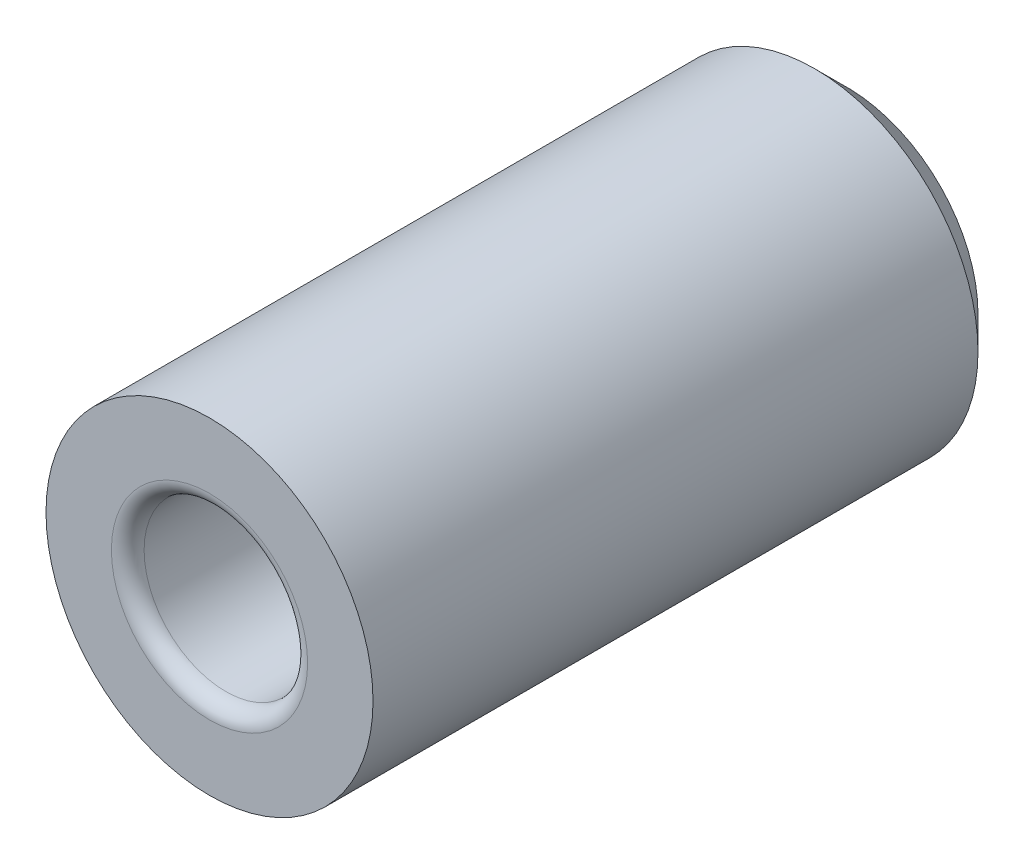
ISO-10303-21;
HEADER;
FILE_DESCRIPTION(('STEP AP214'),'2;1');
FILE_NAME('part.step','',(''),(''),'','','');
FILE_SCHEMA(('AUTOMOTIVE_DESIGN { 1 0 10303 214 1 1 1 1 }'));
ENDSEC;
DATA;
#1=APPLICATION_CONTEXT('core data for automotive mechanical design processes');
#2=APPLICATION_PROTOCOL_DEFINITION('international standard','automotive_design',2000,#1);
#3=PRODUCT_CONTEXT('',#1,'mechanical');
#4=PRODUCT('Part','Part','',(#3));
#5=PRODUCT_RELATED_PRODUCT_CATEGORY('part','',(#4));
#6=PRODUCT_DEFINITION_FORMATION('','',#4);
#7=PRODUCT_DEFINITION_CONTEXT('part definition',#1,'design');
#8=PRODUCT_DEFINITION('design','',#6,#7);
#9=PRODUCT_DEFINITION_SHAPE('','',#8);
#10=(LENGTH_UNIT() NAMED_UNIT(*) SI_UNIT(.MILLI.,.METRE.));
#11=(NAMED_UNIT(*) PLANE_ANGLE_UNIT() SI_UNIT($,.RADIAN.));
#12=(NAMED_UNIT(*) SI_UNIT($,.STERADIAN.) SOLID_ANGLE_UNIT());
#13=UNCERTAINTY_MEASURE_WITH_UNIT(LENGTH_MEASURE(1.E-05),#10,'distance_accuracy_value','');
#14=(GEOMETRIC_REPRESENTATION_CONTEXT(3) GLOBAL_UNCERTAINTY_ASSIGNED_CONTEXT((#13)) GLOBAL_UNIT_ASSIGNED_CONTEXT((#10,
#11,#12)) REPRESENTATION_CONTEXT('',''));
#15=CARTESIAN_POINT('',(0.,0.,0.));
#16=DIRECTION('',(0.,0.,1.));
#17=DIRECTION('',(1.,0.,0.));
#18=AXIS2_PLACEMENT_3D('',#15,#16,#17);
#19=CARTESIAN_POINT('',(0.,0.,-0.5));
#20=DIRECTION('',(0.,0.,-1.));
#21=DIRECTION('',(-1.,0.,0.));
#22=AXIS2_PLACEMENT_3D('',#19,#20,#21);
#23=PLANE('',#22);
#24=CARTESIAN_POINT('',(0.,0.,-0.5));
#25=DIRECTION('',(0.,0.,-1.));
#26=DIRECTION('',(-1.,0.,0.));
#27=AXIS2_PLACEMENT_3D('',#24,#25,#26);
#28=CIRCLE('',#27,3.);
#29=CARTESIAN_POINT('',(-3.,0.,-0.499999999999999));
#30=VERTEX_POINT('',#29);
#31=EDGE_CURVE('E50',#30,#30,#28,.T.);
#32=ORIENTED_EDGE('',*,*,#31,.T.);
#33=EDGE_LOOP('',(#32));
#34=FACE_BOUND('',#33,.T.);
#35=CARTESIAN_POINT('',(0.,0.,-0.5));
#36=DIRECTION('',(0.,0.,-1.));
#37=DIRECTION('',(-1.,0.,0.));
#38=AXIS2_PLACEMENT_3D('',#35,#36,#37);
#39=CIRCLE('',#38,5.);
#40=CARTESIAN_POINT('',(-5.,0.,-0.499999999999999));
#41=VERTEX_POINT('',#40);
#42=EDGE_CURVE('E64',#41,#41,#39,.T.);
#43=ORIENTED_EDGE('',*,*,#42,.F.);
#44=EDGE_LOOP('',(#43));
#45=FACE_BOUND('',#44,.T.);
#46=ADVANCED_FACE('F35',(#34,#45),#23,.F.);
#47=CARTESIAN_POINT('',(0.,0.,-0.5));
#48=DIRECTION('',(0.,0.,-1.));
#49=DIRECTION('',(-1.,0.,0.));
#50=AXIS2_PLACEMENT_3D('',#47,#48,#49);
#51=CYLINDRICAL_SURFACE('',#50,5.);
#52=CARTESIAN_POINT('',(0.,0.,-19.));
#53=DIRECTION('',(0.,0.,1.));
#54=DIRECTION('',(1.,0.,0.));
#55=AXIS2_PLACEMENT_3D('',#52,#53,#54);
#56=CIRCLE('',#55,5.);
#57=CARTESIAN_POINT('',(4.99999999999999,0.,-19.));
#58=VERTEX_POINT('',#57);
#59=EDGE_CURVE('E10',#58,#58,#56,.T.);
#60=ORIENTED_EDGE('',*,*,#59,.T.);
#61=EDGE_LOOP('',(#60));
#62=FACE_BOUND('',#61,.T.);
#63=ORIENTED_EDGE('',*,*,#42,.T.);
#64=EDGE_LOOP('',(#63));
#65=FACE_BOUND('',#64,.T.);
#66=ADVANCED_FACE('F82',(#62,#65),#51,.T.);
#67=CARTESIAN_POINT('',(0.,0.,-20.));
#68=DIRECTION('',(0.,0.,1.));
#69=DIRECTION('',(1.,0.,0.));
#70=AXIS2_PLACEMENT_3D('',#67,#68,#69);
#71=PLANE('',#70);
#72=CARTESIAN_POINT('',(0.,0.,-20.));
#73=DIRECTION('',(0.,0.,1.));
#74=DIRECTION('',(1.,0.,0.));
#75=AXIS2_PLACEMENT_3D('',#72,#73,#74);
#76=CIRCLE('',#75,4.);
#77=CARTESIAN_POINT('',(4.,0.,-20.));
#78=VERTEX_POINT('',#77);
#79=EDGE_CURVE('E42',#78,#78,#76,.F.);
#80=ORIENTED_EDGE('',*,*,#79,.T.);
#81=EDGE_LOOP('',(#80));
#82=FACE_BOUND('',#81,.T.);
#83=CARTESIAN_POINT('',(0.,0.,-20.));
#84=DIRECTION('',(0.,0.,-1.));
#85=DIRECTION('',(-1.,0.,0.));
#86=AXIS2_PLACEMENT_3D('',#83,#84,#85);
#87=CIRCLE('',#86,1.64999999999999);
#88=CARTESIAN_POINT('',(-1.64999999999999,0.,-20.));
#89=VERTEX_POINT('',#88);
#90=EDGE_CURVE('E73',#89,#89,#87,.T.);
#91=ORIENTED_EDGE('',*,*,#90,.F.);
#92=EDGE_LOOP('',(#91));
#93=FACE_BOUND('',#92,.T.);
#94=ADVANCED_FACE('F79',(#82,#93),#71,.F.);
#95=CARTESIAN_POINT('',(0.,0.,-0.5));
#96=DIRECTION('',(0.,0.,-1.));
#97=DIRECTION('',(-1.,0.,0.));
#98=AXIS2_PLACEMENT_3D('',#95,#96,#97);
#99=CYLINDRICAL_SURFACE('',#98,3.75);
#100=CARTESIAN_POINT('',(0.,0.,-6.75));
#101=DIRECTION('',(0.,0.,-1.));
#102=DIRECTION('',(-1.,0.,0.));
#103=AXIS2_PLACEMENT_3D('',#100,#101,#102);
#104=CIRCLE('',#103,3.75);
#105=CARTESIAN_POINT('',(-3.75,0.,-6.75));
#106=VERTEX_POINT('',#105);
#107=EDGE_CURVE('E58',#106,#106,#104,.F.);
#108=ORIENTED_EDGE('',*,*,#107,.T.);
#109=EDGE_LOOP('',(#108));
#110=FACE_BOUND('',#109,.T.);
#111=CARTESIAN_POINT('',(0.,0.,-12.75));
#112=DIRECTION('',(0.,0.,1.));
#113=DIRECTION('',(1.,0.,0.));
#114=AXIS2_PLACEMENT_3D('',#111,#112,#113);
#115=CIRCLE('',#114,3.75);
#116=CARTESIAN_POINT('',(3.75,0.,-12.75));
#117=VERTEX_POINT('',#116);
#118=EDGE_CURVE('E61',#117,#117,#115,.F.);
#119=ORIENTED_EDGE('',*,*,#118,.T.);
#120=EDGE_LOOP('',(#119));
#121=FACE_BOUND('',#120,.T.);
#122=ADVANCED_FACE('F81',(#110,#121),#99,.F.);
#123=CARTESIAN_POINT('',(0.,0.,-14.));
#124=DIRECTION('',(0.,0.,1.));
#125=DIRECTION('',(1.,0.,0.));
#126=AXIS2_PLACEMENT_3D('',#123,#124,#125);
#127=PLANE('',#126);
#128=CARTESIAN_POINT('',(0.,0.,-14.));
#129=DIRECTION('',(0.,0.,1.));
#130=DIRECTION('',(1.,0.,0.));
#131=AXIS2_PLACEMENT_3D('',#128,#129,#130);
#132=CIRCLE('',#131,1.64999999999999);
#133=CARTESIAN_POINT('',(1.64999999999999,0.,-14.));
#134=VERTEX_POINT('',#133);
#135=EDGE_CURVE('E70',#134,#134,#132,.T.);
#136=ORIENTED_EDGE('',*,*,#135,.F.);
#137=EDGE_LOOP('',(#136));
#138=FACE_BOUND('',#137,.T.);
#139=CARTESIAN_POINT('',(0.,0.,-14.));
#140=DIRECTION('',(0.,0.,1.));
#141=DIRECTION('',(1.,0.,0.));
#142=AXIS2_PLACEMENT_3D('',#139,#140,#141);
#143=CIRCLE('',#142,2.5);
#144=CARTESIAN_POINT('',(2.5,0.,-14.));
#145=VERTEX_POINT('',#144);
#146=EDGE_CURVE('E55',#145,#145,#143,.T.);
#147=ORIENTED_EDGE('',*,*,#146,.T.);
#148=EDGE_LOOP('',(#147));
#149=FACE_BOUND('',#148,.T.);
#150=ADVANCED_FACE('F88',(#138,#149),#127,.T.);
#151=CARTESIAN_POINT('',(0.,0.,-0.5));
#152=DIRECTION('',(0.,0.,-1.));
#153=DIRECTION('',(-1.,0.,0.));
#154=AXIS2_PLACEMENT_3D('',#151,#152,#153);
#155=CYLINDRICAL_SURFACE('',#154,2.5);
#156=CARTESIAN_POINT('',(0.,0.,-1.));
#157=DIRECTION('',(0.,0.,-1.));
#158=DIRECTION('',(-1.,0.,0.));
#159=AXIS2_PLACEMENT_3D('',#156,#157,#158);
#160=CIRCLE('',#159,2.5);
#161=CARTESIAN_POINT('',(-2.5,0.,-1.));
#162=VERTEX_POINT('',#161);
#163=EDGE_CURVE('E46',#162,#162,#160,.F.);
#164=ORIENTED_EDGE('',*,*,#163,.T.);
#165=EDGE_LOOP('',(#164));
#166=FACE_BOUND('',#165,.T.);
#167=CARTESIAN_POINT('',(0.,0.,-5.5));
#168=DIRECTION('',(0.,0.,-1.));
#169=DIRECTION('',(-1.,0.,0.));
#170=AXIS2_PLACEMENT_3D('',#167,#168,#169);
#171=CIRCLE('',#170,2.5);
#172=CARTESIAN_POINT('',(-2.5,0.,-5.5));
#173=VERTEX_POINT('',#172);
#174=EDGE_CURVE('E67',#173,#173,#171,.T.);
#175=ORIENTED_EDGE('',*,*,#174,.T.);
#176=EDGE_LOOP('',(#175));
#177=FACE_BOUND('',#176,.T.);
#178=ADVANCED_FACE('F103',(#166,#177),#155,.F.);
#179=CARTESIAN_POINT('',(0.,0.,-6.75));
#180=DIRECTION('',(0.,0.,-1.));
#181=DIRECTION('',(-1.,0.,0.));
#182=AXIS2_PLACEMENT_3D('',#179,#180,#181);
#183=TOROIDAL_SURFACE('',#182,2.5,1.25);
#184=ORIENTED_EDGE('',*,*,#107,.F.);
#185=EDGE_LOOP('',(#184));
#186=FACE_BOUND('',#185,.T.);
#187=ORIENTED_EDGE('',*,*,#174,.F.);
#188=EDGE_LOOP('',(#187));
#189=FACE_BOUND('',#188,.T.);
#190=ADVANCED_FACE('F99',(#186,#189),#183,.F.);
#191=CARTESIAN_POINT('',(0.,0.,-12.75));
#192=DIRECTION('',(0.,0.,1.));
#193=DIRECTION('',(1.,0.,0.));
#194=AXIS2_PLACEMENT_3D('',#191,#192,#193);
#195=TOROIDAL_SURFACE('',#194,2.5,1.25);
#196=ORIENTED_EDGE('',*,*,#146,.F.);
#197=EDGE_LOOP('',(#196));
#198=FACE_BOUND('',#197,.T.);
#199=ORIENTED_EDGE('',*,*,#118,.F.);
#200=EDGE_LOOP('',(#199));
#201=FACE_BOUND('',#200,.T.);
#202=ADVANCED_FACE('F102',(#198,#201),#195,.F.);
#203=CARTESIAN_POINT('',(0.,0.,-20.));
#204=DIRECTION('',(0.,0.,-1.));
#205=DIRECTION('',(-1.,0.,0.));
#206=AXIS2_PLACEMENT_3D('',#203,#204,#205);
#207=CYLINDRICAL_SURFACE('',#206,1.64999999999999);
#208=ORIENTED_EDGE('',*,*,#135,.T.);
#209=EDGE_LOOP('',(#208));
#210=FACE_BOUND('',#209,.T.);
#211=ORIENTED_EDGE('',*,*,#90,.T.);
#212=EDGE_LOOP('',(#211));
#213=FACE_BOUND('',#212,.T.);
#214=ADVANCED_FACE('F77',(#210,#213),#207,.F.);
#215=CARTESIAN_POINT('',(0.,0.,-1.));
#216=DIRECTION('',(0.,0.,-1.));
#217=DIRECTION('',(-1.,0.,0.));
#218=AXIS2_PLACEMENT_3D('',#215,#216,#217);
#219=TOROIDAL_SURFACE('',#218,3.,0.5);
#220=ORIENTED_EDGE('',*,*,#163,.F.);
#221=EDGE_LOOP('',(#220));
#222=FACE_BOUND('',#221,.T.);
#223=ORIENTED_EDGE('',*,*,#31,.F.);
#224=EDGE_LOOP('',(#223));
#225=FACE_BOUND('',#224,.T.);
#226=ADVANCED_FACE('F107',(#222,#225),#219,.T.);
#227=CARTESIAN_POINT('',(0.,0.,-20.));
#228=DIRECTION('',(0.,0.,1.));
#229=DIRECTION('',(1.,0.,0.));
#230=AXIS2_PLACEMENT_3D('',#227,#228,#229);
#231=CONICAL_SURFACE('',#230,4.,0.785398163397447);
#232=ORIENTED_EDGE('',*,*,#59,.F.);
#233=EDGE_LOOP('',(#232));
#234=FACE_BOUND('',#233,.T.);
#235=ORIENTED_EDGE('',*,*,#79,.F.);
#236=EDGE_LOOP('',(#235));
#237=FACE_BOUND('',#236,.T.);
#238=ADVANCED_FACE('F37',(#234,#237),#231,.T.);
#239=CLOSED_SHELL('',(#46,#66,#94,#122,#150,#178,#190,#202,#214,#226,#238));
#240=MANIFOLD_SOLID_BREP('B2',#239);
#241=ADVANCED_BREP_SHAPE_REPRESENTATION('',(#18,#240),#14);
#242=SHAPE_DEFINITION_REPRESENTATION(#9,#241);
ENDSEC;
END-ISO-10303-21;
